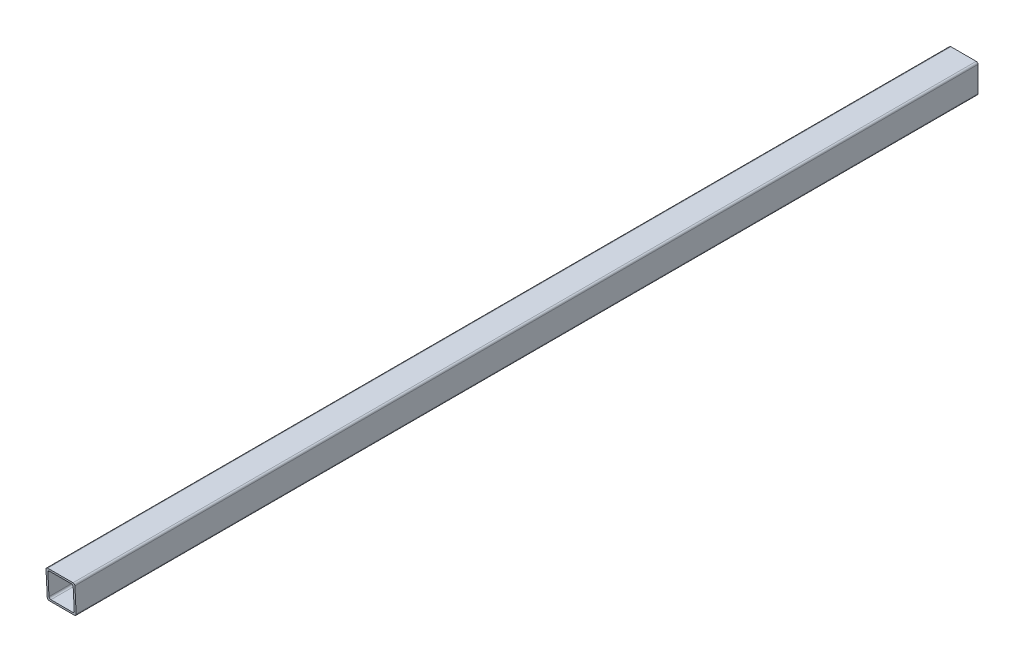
ISO-10303-21;
HEADER;
FILE_DESCRIPTION(('STEP AP214'),'2;1');
FILE_NAME('part.step','',(''),(''),'','','');
FILE_SCHEMA(('AUTOMOTIVE_DESIGN { 1 0 10303 214 1 1 1 1 }'));
ENDSEC;
DATA;
#1=APPLICATION_CONTEXT('core data for automotive mechanical design processes');
#2=APPLICATION_PROTOCOL_DEFINITION('international standard','automotive_design',2000,#1);
#3=PRODUCT_CONTEXT('',#1,'mechanical');
#4=PRODUCT('Part','Part','',(#3));
#5=PRODUCT_RELATED_PRODUCT_CATEGORY('part','',(#4));
#6=PRODUCT_DEFINITION_FORMATION('','',#4);
#7=PRODUCT_DEFINITION_CONTEXT('part definition',#1,'design');
#8=PRODUCT_DEFINITION('design','',#6,#7);
#9=PRODUCT_DEFINITION_SHAPE('','',#8);
#10=(LENGTH_UNIT() NAMED_UNIT(*) SI_UNIT(.MILLI.,.METRE.));
#11=(NAMED_UNIT(*) PLANE_ANGLE_UNIT() SI_UNIT($,.RADIAN.));
#12=(NAMED_UNIT(*) SI_UNIT($,.STERADIAN.) SOLID_ANGLE_UNIT());
#13=UNCERTAINTY_MEASURE_WITH_UNIT(LENGTH_MEASURE(1.E-05),#10,'distance_accuracy_value','');
#14=(GEOMETRIC_REPRESENTATION_CONTEXT(3) GLOBAL_UNCERTAINTY_ASSIGNED_CONTEXT((#13)) GLOBAL_UNIT_ASSIGNED_CONTEXT((#10,
#11,#12)) REPRESENTATION_CONTEXT('',''));
#15=CARTESIAN_POINT('',(0.,0.,0.));
#16=DIRECTION('',(0.,0.,1.));
#17=DIRECTION('',(1.,0.,0.));
#18=AXIS2_PLACEMENT_3D('',#15,#16,#17);
#19=CARTESIAN_POINT('',(-40.,-40.,0.));
#20=DIRECTION('',(0.,0.,1.));
#21=DIRECTION('',(1.,0.,0.));
#22=AXIS2_PLACEMENT_3D('',#19,#20,#21);
#23=PLANE('',#22);
#24=DIRECTION('',(0.,1.,0.));
#25=VECTOR('',#24,1.);
#26=CARTESIAN_POINT('',(40.,40.,0.));
#27=LINE('',#26,#25);
#28=CARTESIAN_POINT('',(40.,-35.,0.));
#29=VERTEX_POINT('',#28);
#30=CARTESIAN_POINT('',(40.,35.,0.));
#31=VERTEX_POINT('',#30);
#32=EDGE_CURVE('E265',#29,#31,#27,.T.);
#33=ORIENTED_EDGE('',*,*,#32,.F.);
#34=CARTESIAN_POINT('',(35.,-35.,0.));
#35=DIRECTION('',(0.,0.,1.));
#36=DIRECTION('',(1.,0.,0.));
#37=AXIS2_PLACEMENT_3D('',#34,#35,#36);
#38=CIRCLE('',#37,5.);
#39=CARTESIAN_POINT('',(35.,-40.,0.));
#40=VERTEX_POINT('',#39);
#41=EDGE_CURVE('E174',#29,#40,#38,.F.);
#42=ORIENTED_EDGE('',*,*,#41,.T.);
#43=DIRECTION('',(1.,0.,0.));
#44=VECTOR('',#43,1.);
#45=CARTESIAN_POINT('',(-40.,-40.,0.));
#46=LINE('',#45,#44);
#47=CARTESIAN_POINT('',(-35.,-40.,0.));
#48=VERTEX_POINT('',#47);
#49=EDGE_CURVE('E269',#48,#40,#46,.T.);
#50=ORIENTED_EDGE('',*,*,#49,.F.);
#51=CARTESIAN_POINT('',(-35.,-35.,0.));
#52=DIRECTION('',(0.,0.,1.));
#53=DIRECTION('',(1.,0.,0.));
#54=AXIS2_PLACEMENT_3D('',#51,#52,#53);
#55=CIRCLE('',#54,5.);
#56=CARTESIAN_POINT('',(-40.,-35.,0.));
#57=VERTEX_POINT('',#56);
#58=EDGE_CURVE('E184',#48,#57,#55,.F.);
#59=ORIENTED_EDGE('',*,*,#58,.T.);
#60=DIRECTION('',(0.,-1.,0.));
#61=VECTOR('',#60,1.);
#62=CARTESIAN_POINT('',(-40.,40.,0.));
#63=LINE('',#62,#61);
#64=CARTESIAN_POINT('',(-40.,35.,0.));
#65=VERTEX_POINT('',#64);
#66=EDGE_CURVE('E272',#65,#57,#63,.T.);
#67=ORIENTED_EDGE('',*,*,#66,.F.);
#68=CARTESIAN_POINT('',(-35.,35.,0.));
#69=DIRECTION('',(0.,0.,1.));
#70=DIRECTION('',(1.,0.,0.));
#71=AXIS2_PLACEMENT_3D('',#68,#69,#70);
#72=CIRCLE('',#71,5.);
#73=CARTESIAN_POINT('',(-35.,40.,0.));
#74=VERTEX_POINT('',#73);
#75=EDGE_CURVE('E175',#65,#74,#72,.F.);
#76=ORIENTED_EDGE('',*,*,#75,.T.);
#77=DIRECTION('',(-1.,0.,0.));
#78=VECTOR('',#77,1.);
#79=CARTESIAN_POINT('',(-40.,40.,0.));
#80=LINE('',#79,#78);
#81=CARTESIAN_POINT('',(35.,40.,0.));
#82=VERTEX_POINT('',#81);
#83=EDGE_CURVE('E264',#82,#74,#80,.T.);
#84=ORIENTED_EDGE('',*,*,#83,.F.);
#85=CARTESIAN_POINT('',(35.,35.,0.));
#86=DIRECTION('',(0.,0.,1.));
#87=DIRECTION('',(1.,0.,0.));
#88=AXIS2_PLACEMENT_3D('',#85,#86,#87);
#89=CIRCLE('',#88,5.);
#90=EDGE_CURVE('E177',#82,#31,#89,.F.);
#91=ORIENTED_EDGE('',*,*,#90,.T.);
#92=EDGE_LOOP('',(#33,#42,#50,#59,#67,#76,#84,#91));
#93=FACE_BOUND('',#92,.T.);
#94=DIRECTION('',(-1.,0.,0.));
#95=VECTOR('',#94,1.);
#96=CARTESIAN_POINT('',(-35.,35.,0.));
#97=LINE('',#96,#95);
#98=CARTESIAN_POINT('',(30.,35.,0.));
#99=VERTEX_POINT('',#98);
#100=CARTESIAN_POINT('',(-30.,35.,0.));
#101=VERTEX_POINT('',#100);
#102=EDGE_CURVE('E241',#99,#101,#97,.T.);
#103=ORIENTED_EDGE('',*,*,#102,.T.);
#104=CARTESIAN_POINT('',(-30.,30.,0.));
#105=DIRECTION('',(0.,0.,1.));
#106=DIRECTION('',(1.,0.,0.));
#107=AXIS2_PLACEMENT_3D('',#104,#105,#106);
#108=CIRCLE('',#107,5.);
#109=CARTESIAN_POINT('',(-35.,30.,0.));
#110=VERTEX_POINT('',#109);
#111=EDGE_CURVE('E46',#101,#110,#108,.T.);
#112=ORIENTED_EDGE('',*,*,#111,.T.);
#113=DIRECTION('',(0.,-1.,0.));
#114=VECTOR('',#113,1.);
#115=CARTESIAN_POINT('',(-35.,35.,0.));
#116=LINE('',#115,#114);
#117=CARTESIAN_POINT('',(-35.,-30.,0.));
#118=VERTEX_POINT('',#117);
#119=EDGE_CURVE('E239',#110,#118,#116,.T.);
#120=ORIENTED_EDGE('',*,*,#119,.T.);
#121=CARTESIAN_POINT('',(-30.,-30.,0.));
#122=DIRECTION('',(0.,0.,1.));
#123=DIRECTION('',(1.,0.,0.));
#124=AXIS2_PLACEMENT_3D('',#121,#122,#123);
#125=CIRCLE('',#124,5.);
#126=CARTESIAN_POINT('',(-30.,-35.,0.));
#127=VERTEX_POINT('',#126);
#128=EDGE_CURVE('E228',#118,#127,#125,.T.);
#129=ORIENTED_EDGE('',*,*,#128,.T.);
#130=DIRECTION('',(1.,0.,0.));
#131=VECTOR('',#130,1.);
#132=CARTESIAN_POINT('',(-35.,-35.,0.));
#133=LINE('',#132,#131);
#134=CARTESIAN_POINT('',(30.,-35.,0.));
#135=VERTEX_POINT('',#134);
#136=EDGE_CURVE('E250',#127,#135,#133,.T.);
#137=ORIENTED_EDGE('',*,*,#136,.T.);
#138=CARTESIAN_POINT('',(30.,-30.,0.));
#139=DIRECTION('',(0.,0.,1.));
#140=DIRECTION('',(1.,0.,0.));
#141=AXIS2_PLACEMENT_3D('',#138,#139,#140);
#142=CIRCLE('',#141,5.);
#143=CARTESIAN_POINT('',(35.,-30.,0.));
#144=VERTEX_POINT('',#143);
#145=EDGE_CURVE('E224',#135,#144,#142,.T.);
#146=ORIENTED_EDGE('',*,*,#145,.T.);
#147=DIRECTION('',(0.,1.,0.));
#148=VECTOR('',#147,1.);
#149=CARTESIAN_POINT('',(35.,35.,0.));
#150=LINE('',#149,#148);
#151=CARTESIAN_POINT('',(35.,30.,0.));
#152=VERTEX_POINT('',#151);
#153=EDGE_CURVE('E276',#144,#152,#150,.T.);
#154=ORIENTED_EDGE('',*,*,#153,.T.);
#155=CARTESIAN_POINT('',(30.,30.,0.));
#156=DIRECTION('',(0.,0.,1.));
#157=DIRECTION('',(1.,0.,0.));
#158=AXIS2_PLACEMENT_3D('',#155,#156,#157);
#159=CIRCLE('',#158,5.);
#160=EDGE_CURVE('E232',#152,#99,#159,.T.);
#161=ORIENTED_EDGE('',*,*,#160,.T.);
#162=EDGE_LOOP('',(#103,#112,#120,#129,#137,#146,#154,#161));
#163=FACE_BOUND('',#162,.T.);
#164=ADVANCED_FACE('F38',(#93,#163),#23,.F.);
#165=CARTESIAN_POINT('',(-40.,40.,3000.));
#166=DIRECTION('',(1.,0.,0.));
#167=DIRECTION('',(0.,1.,0.));
#168=AXIS2_PLACEMENT_3D('',#165,#166,#167);
#169=PLANE('',#168);
#170=ORIENTED_EDGE('',*,*,#66,.T.);
#171=DIRECTION('',(0.,0.,-1.));
#172=VECTOR('',#171,1.);
#173=CARTESIAN_POINT('',(-40.,-35.,3000.));
#174=LINE('',#173,#172);
#175=CARTESIAN_POINT('',(-40.,-35.,2496.2499995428));
#176=VERTEX_POINT('',#175);
#177=EDGE_CURVE('E208',#57,#176,#174,.F.);
#178=ORIENTED_EDGE('',*,*,#177,.T.);
#179=DIRECTION('',(0.,0.998752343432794,0.0499375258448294));
#180=VECTOR('',#179,1.);
#181=CARTESIAN_POINT('',(-40.,-40.,2496.));
#182=LINE('',#181,#180);
#183=CARTESIAN_POINT('',(-40.,35.,2499.74999314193));
#184=VERTEX_POINT('',#183);
#185=EDGE_CURVE('E171',#176,#184,#182,.T.);
#186=ORIENTED_EDGE('',*,*,#185,.T.);
#187=DIRECTION('',(0.,0.,-1.));
#188=VECTOR('',#187,1.);
#189=CARTESIAN_POINT('',(-40.,35.,3000.));
#190=LINE('',#189,#188);
#191=EDGE_CURVE('E205',#184,#65,#190,.T.);
#192=ORIENTED_EDGE('',*,*,#191,.T.);
#193=EDGE_LOOP('',(#170,#178,#186,#192));
#194=FACE_BOUND('',#193,.T.);
#195=ADVANCED_FACE('F293',(#194),#169,.F.);
#196=CARTESIAN_POINT('',(-40.,-40.,3000.));
#197=DIRECTION('',(0.,1.,0.));
#198=DIRECTION('',(-1.,0.,0.));
#199=AXIS2_PLACEMENT_3D('',#196,#197,#198);
#200=PLANE('',#199);
#201=ORIENTED_EDGE('',*,*,#49,.T.);
#202=DIRECTION('',(0.,0.,-1.));
#203=VECTOR('',#202,1.);
#204=CARTESIAN_POINT('',(35.,-40.,3000.));
#205=LINE('',#204,#203);
#206=CARTESIAN_POINT('',(35.,-40.,2496.));
#207=VERTEX_POINT('',#206);
#208=EDGE_CURVE('E190',#40,#207,#205,.F.);
#209=ORIENTED_EDGE('',*,*,#208,.T.);
#210=DIRECTION('',(1.,0.,0.));
#211=VECTOR('',#210,1.);
#212=CARTESIAN_POINT('',(-40.,-40.,2496.));
#213=LINE('',#212,#211);
#214=CARTESIAN_POINT('',(-35.,-40.,2496.));
#215=VERTEX_POINT('',#214);
#216=EDGE_CURVE('E156',#215,#207,#213,.T.);
#217=ORIENTED_EDGE('',*,*,#216,.F.);
#218=DIRECTION('',(0.,0.,-1.));
#219=VECTOR('',#218,1.);
#220=CARTESIAN_POINT('',(-35.,-40.,3000.));
#221=LINE('',#220,#219);
#222=EDGE_CURVE('E187',#215,#48,#221,.T.);
#223=ORIENTED_EDGE('',*,*,#222,.T.);
#224=EDGE_LOOP('',(#201,#209,#217,#223));
#225=FACE_BOUND('',#224,.T.);
#226=ADVANCED_FACE('F307',(#225),#200,.F.);
#227=CARTESIAN_POINT('',(40.,40.,3000.));
#228=DIRECTION('',(-1.,0.,0.));
#229=DIRECTION('',(0.,-1.,0.));
#230=AXIS2_PLACEMENT_3D('',#227,#228,#229);
#231=PLANE('',#230);
#232=DIRECTION('',(0.,0.998752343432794,0.0499375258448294));
#233=VECTOR('',#232,1.);
#234=CARTESIAN_POINT('',(40.,-40.,2496.));
#235=LINE('',#234,#233);
#236=CARTESIAN_POINT('',(40.,-35.,2496.2499995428));
#237=VERTEX_POINT('',#236);
#238=CARTESIAN_POINT('',(40.,35.,2499.74999314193));
#239=VERTEX_POINT('',#238);
#240=EDGE_CURVE('E154',#237,#239,#235,.T.);
#241=ORIENTED_EDGE('',*,*,#240,.F.);
#242=DIRECTION('',(0.,0.,-1.));
#243=VECTOR('',#242,1.);
#244=CARTESIAN_POINT('',(40.,-35.,3000.));
#245=LINE('',#244,#243);
#246=EDGE_CURVE('E167',#237,#29,#245,.T.);
#247=ORIENTED_EDGE('',*,*,#246,.T.);
#248=ORIENTED_EDGE('',*,*,#32,.T.);
#249=DIRECTION('',(0.,0.,-1.));
#250=VECTOR('',#249,1.);
#251=CARTESIAN_POINT('',(40.,35.,3000.));
#252=LINE('',#251,#250);
#253=EDGE_CURVE('E170',#31,#239,#252,.F.);
#254=ORIENTED_EDGE('',*,*,#253,.T.);
#255=EDGE_LOOP('',(#241,#247,#248,#254));
#256=FACE_BOUND('',#255,.T.);
#257=ADVANCED_FACE('F165',(#256),#231,.F.);
#258=CARTESIAN_POINT('',(-40.,40.,3000.));
#259=DIRECTION('',(0.,-1.,0.));
#260=DIRECTION('',(1.,0.,0.));
#261=AXIS2_PLACEMENT_3D('',#258,#259,#260);
#262=PLANE('',#261);
#263=DIRECTION('',(1.,0.,0.));
#264=VECTOR('',#263,1.);
#265=CARTESIAN_POINT('',(-40.,40.,2499.99999268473));
#266=LINE('',#265,#264);
#267=CARTESIAN_POINT('',(-35.,40.,2499.99999268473));
#268=VERTEX_POINT('',#267);
#269=CARTESIAN_POINT('',(35.,40.,2499.99999268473));
#270=VERTEX_POINT('',#269);
#271=EDGE_CURVE('E251',#268,#270,#266,.T.);
#272=ORIENTED_EDGE('',*,*,#271,.T.);
#273=DIRECTION('',(0.,0.,-1.));
#274=VECTOR('',#273,1.);
#275=CARTESIAN_POINT('',(35.,40.,3000.));
#276=LINE('',#275,#274);
#277=EDGE_CURVE('E221',#270,#82,#276,.T.);
#278=ORIENTED_EDGE('',*,*,#277,.T.);
#279=ORIENTED_EDGE('',*,*,#83,.T.);
#280=DIRECTION('',(0.,0.,-1.));
#281=VECTOR('',#280,1.);
#282=CARTESIAN_POINT('',(-35.,40.,3000.));
#283=LINE('',#282,#281);
#284=EDGE_CURVE('E60',#74,#268,#283,.F.);
#285=ORIENTED_EDGE('',*,*,#284,.T.);
#286=EDGE_LOOP('',(#272,#278,#279,#285));
#287=FACE_BOUND('',#286,.T.);
#288=ADVANCED_FACE('F301',(#287),#262,.F.);
#289=CARTESIAN_POINT('',(-35.,35.,3000.));
#290=DIRECTION('',(1.,0.,0.));
#291=DIRECTION('',(0.,1.,0.));
#292=AXIS2_PLACEMENT_3D('',#289,#290,#291);
#293=PLANE('',#292);
#294=DIRECTION('',(0.,0.998752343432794,0.0499375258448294));
#295=VECTOR('',#294,1.);
#296=CARTESIAN_POINT('',(-35.,59.9500796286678,2500.99749484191));
#297=LINE('',#296,#295);
#298=CARTESIAN_POINT('',(-35.,-30.,2496.49999908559));
#299=VERTEX_POINT('',#298);
#300=CARTESIAN_POINT('',(-35.,30.,2499.49999359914));
#301=VERTEX_POINT('',#300);
#302=EDGE_CURVE('E260',#299,#301,#297,.T.);
#303=ORIENTED_EDGE('',*,*,#302,.F.);
#304=DIRECTION('',(0.,0.,-1.));
#305=VECTOR('',#304,1.);
#306=CARTESIAN_POINT('',(-35.,-30.,0.));
#307=LINE('',#306,#305);
#308=EDGE_CURVE('E212',#299,#118,#307,.T.);
#309=ORIENTED_EDGE('',*,*,#308,.T.);
#310=ORIENTED_EDGE('',*,*,#119,.F.);
#311=DIRECTION('',(0.,0.,-1.));
#312=VECTOR('',#311,1.);
#313=CARTESIAN_POINT('',(-35.,30.,2499.74999314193));
#314=LINE('',#313,#312);
#315=EDGE_CURVE('E210',#110,#301,#314,.F.);
#316=ORIENTED_EDGE('',*,*,#315,.T.);
#317=EDGE_LOOP('',(#303,#309,#310,#316));
#318=FACE_BOUND('',#317,.T.);
#319=ADVANCED_FACE('F247',(#318),#293,.T.);
#320=CARTESIAN_POINT('',(-35.,-35.,3000.));
#321=DIRECTION('',(0.,1.,0.));
#322=DIRECTION('',(0.,0.,1.));
#323=AXIS2_PLACEMENT_3D('',#320,#321,#322);
#324=PLANE('',#323);
#325=DIRECTION('',(-1.,0.,0.));
#326=VECTOR('',#325,1.);
#327=CARTESIAN_POINT('',(-35.,-35.,2496.2499995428));
#328=LINE('',#327,#326);
#329=CARTESIAN_POINT('',(30.,-35.,2496.2499995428));
#330=VERTEX_POINT('',#329);
#331=CARTESIAN_POINT('',(-30.,-35.,2496.2499995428));
#332=VERTEX_POINT('',#331);
#333=EDGE_CURVE('E283',#330,#332,#328,.T.);
#334=ORIENTED_EDGE('',*,*,#333,.F.);
#335=DIRECTION('',(0.,0.,-1.));
#336=VECTOR('',#335,1.);
#337=CARTESIAN_POINT('',(30.,-35.,0.));
#338=LINE('',#337,#336);
#339=EDGE_CURVE('E197',#330,#135,#338,.T.);
#340=ORIENTED_EDGE('',*,*,#339,.T.);
#341=ORIENTED_EDGE('',*,*,#136,.F.);
#342=DIRECTION('',(0.,0.,-1.));
#343=VECTOR('',#342,1.);
#344=CARTESIAN_POINT('',(-30.,-35.,2496.2499995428));
#345=LINE('',#344,#343);
#346=EDGE_CURVE('E160',#127,#332,#345,.F.);
#347=ORIENTED_EDGE('',*,*,#346,.T.);
#348=EDGE_LOOP('',(#334,#340,#341,#347));
#349=FACE_BOUND('',#348,.T.);
#350=ADVANCED_FACE('F351',(#349),#324,.T.);
#351=CARTESIAN_POINT('',(35.,35.,3000.));
#352=DIRECTION('',(-1.,0.,0.));
#353=DIRECTION('',(0.,-1.,0.));
#354=AXIS2_PLACEMENT_3D('',#351,#352,#353);
#355=PLANE('',#354);
#356=ORIENTED_EDGE('',*,*,#153,.F.);
#357=DIRECTION('',(0.,0.,-1.));
#358=VECTOR('',#357,1.);
#359=CARTESIAN_POINT('',(35.,-30.,2496.2499995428));
#360=LINE('',#359,#358);
#361=CARTESIAN_POINT('',(35.,-30.,2496.49999908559));
#362=VERTEX_POINT('',#361);
#363=EDGE_CURVE('E203',#144,#362,#360,.F.);
#364=ORIENTED_EDGE('',*,*,#363,.T.);
#365=DIRECTION('',(0.,-0.998752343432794,-0.0499375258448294));
#366=VECTOR('',#365,1.);
#367=CARTESIAN_POINT('',(35.,59.9500796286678,2500.99749484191));
#368=LINE('',#367,#366);
#369=CARTESIAN_POINT('',(35.,30.,2499.49999359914));
#370=VERTEX_POINT('',#369);
#371=EDGE_CURVE('E285',#370,#362,#368,.T.);
#372=ORIENTED_EDGE('',*,*,#371,.F.);
#373=DIRECTION('',(0.,0.,-1.));
#374=VECTOR('',#373,1.);
#375=CARTESIAN_POINT('',(35.,30.,0.));
#376=LINE('',#375,#374);
#377=EDGE_CURVE('E200',#370,#152,#376,.T.);
#378=ORIENTED_EDGE('',*,*,#377,.T.);
#379=EDGE_LOOP('',(#356,#364,#372,#378));
#380=FACE_BOUND('',#379,.T.);
#381=ADVANCED_FACE('F347',(#380),#355,.T.);
#382=CARTESIAN_POINT('',(-35.,35.,3000.));
#383=DIRECTION('',(0.,-1.,0.));
#384=DIRECTION('',(0.,0.,-1.));
#385=AXIS2_PLACEMENT_3D('',#382,#383,#384);
#386=PLANE('',#385);
#387=ORIENTED_EDGE('',*,*,#102,.F.);
#388=DIRECTION('',(0.,0.,-1.));
#389=VECTOR('',#388,1.);
#390=CARTESIAN_POINT('',(30.,35.,2499.74999314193));
#391=LINE('',#390,#389);
#392=CARTESIAN_POINT('',(30.,35.,2499.74999314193));
#393=VERTEX_POINT('',#392);
#394=EDGE_CURVE('E218',#99,#393,#391,.F.);
#395=ORIENTED_EDGE('',*,*,#394,.T.);
#396=DIRECTION('',(1.,0.,0.));
#397=VECTOR('',#396,1.);
#398=CARTESIAN_POINT('',(-35.,35.,2499.74999314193));
#399=LINE('',#398,#397);
#400=CARTESIAN_POINT('',(-30.,35.,2499.74999314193));
#401=VERTEX_POINT('',#400);
#402=EDGE_CURVE('E179',#401,#393,#399,.T.);
#403=ORIENTED_EDGE('',*,*,#402,.F.);
#404=DIRECTION('',(0.,0.,-1.));
#405=VECTOR('',#404,1.);
#406=CARTESIAN_POINT('',(-30.,35.,0.));
#407=LINE('',#406,#405);
#408=EDGE_CURVE('E215',#401,#101,#407,.T.);
#409=ORIENTED_EDGE('',*,*,#408,.T.);
#410=EDGE_LOOP('',(#387,#395,#403,#409));
#411=FACE_BOUND('',#410,.T.);
#412=ADVANCED_FACE('F262',(#411),#386,.T.);
#413=CARTESIAN_POINT('',(-40.,-40.,2496.));
#414=DIRECTION('',(0.,0.0499375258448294,-0.998752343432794));
#415=DIRECTION('',(0.,0.998752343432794,0.0499375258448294));
#416=AXIS2_PLACEMENT_3D('',#413,#414,#415);
#417=PLANE('',#416);
#418=ORIENTED_EDGE('',*,*,#333,.T.);
#419=CARTESIAN_POINT('',(-30.,-30.,2496.49999908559));
#420=DIRECTION('',(0.,0.0499375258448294,-0.998752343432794));
#421=DIRECTION('',(0.,0.998752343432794,0.0499375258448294));
#422=AXIS2_PLACEMENT_3D('',#419,#420,#421);
#423=ELLIPSE('',#422,5.00624607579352,5.);
#424=EDGE_CURVE('E230',#332,#299,#423,.T.);
#425=ORIENTED_EDGE('',*,*,#424,.T.);
#426=ORIENTED_EDGE('',*,*,#302,.T.);
#427=CARTESIAN_POINT('',(-30.,30.,2499.49999359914));
#428=DIRECTION('',(0.,0.0499375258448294,-0.998752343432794));
#429=DIRECTION('',(0.,0.998752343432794,0.0499375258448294));
#430=AXIS2_PLACEMENT_3D('',#427,#428,#429);
#431=ELLIPSE('',#430,5.00624607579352,5.);
#432=EDGE_CURVE('E11',#301,#401,#431,.T.);
#433=ORIENTED_EDGE('',*,*,#432,.T.);
#434=ORIENTED_EDGE('',*,*,#402,.T.);
#435=CARTESIAN_POINT('',(30.,30.,2499.49999359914));
#436=DIRECTION('',(0.,0.0499375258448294,-0.998752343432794));
#437=DIRECTION('',(0.,0.998752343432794,0.0499375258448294));
#438=AXIS2_PLACEMENT_3D('',#435,#436,#437);
#439=ELLIPSE('',#438,5.00624607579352,5.);
#440=EDGE_CURVE('E234',#393,#370,#439,.T.);
#441=ORIENTED_EDGE('',*,*,#440,.T.);
#442=ORIENTED_EDGE('',*,*,#371,.T.);
#443=CARTESIAN_POINT('',(30.,-30.,2496.49999908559));
#444=DIRECTION('',(0.,0.0499375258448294,-0.998752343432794));
#445=DIRECTION('',(0.,0.998752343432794,0.0499375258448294));
#446=AXIS2_PLACEMENT_3D('',#443,#444,#445);
#447=ELLIPSE('',#446,5.00624607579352,5.);
#448=EDGE_CURVE('E226',#362,#330,#447,.T.);
#449=ORIENTED_EDGE('',*,*,#448,.T.);
#450=EDGE_LOOP('',(#418,#425,#426,#433,#434,#441,#442,#449));
#451=FACE_BOUND('',#450,.T.);
#452=ORIENTED_EDGE('',*,*,#216,.T.);
#453=CARTESIAN_POINT('',(35.,-35.,2496.2499995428));
#454=DIRECTION('',(0.,0.0499375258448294,-0.998752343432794));
#455=DIRECTION('',(0.,-0.998752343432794,-0.0499375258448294));
#456=AXIS2_PLACEMENT_3D('',#453,#454,#455);
#457=ELLIPSE('',#456,5.00624607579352,5.);
#458=EDGE_CURVE('E151',#207,#237,#457,.F.);
#459=ORIENTED_EDGE('',*,*,#458,.T.);
#460=ORIENTED_EDGE('',*,*,#240,.T.);
#461=CARTESIAN_POINT('',(35.,35.,2499.74999314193));
#462=DIRECTION('',(0.,0.0499375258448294,-0.998752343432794));
#463=DIRECTION('',(0.,-0.998752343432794,-0.0499375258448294));
#464=AXIS2_PLACEMENT_3D('',#461,#462,#463);
#465=ELLIPSE('',#464,5.00624607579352,5.);
#466=EDGE_CURVE('E53',#239,#270,#465,.F.);
#467=ORIENTED_EDGE('',*,*,#466,.T.);
#468=ORIENTED_EDGE('',*,*,#271,.F.);
#469=CARTESIAN_POINT('',(-35.,35.,2499.74999314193));
#470=DIRECTION('',(0.,0.0499375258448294,-0.998752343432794));
#471=DIRECTION('',(0.,-0.998752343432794,-0.0499375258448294));
#472=AXIS2_PLACEMENT_3D('',#469,#470,#471);
#473=ELLIPSE('',#472,5.00624607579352,5.);
#474=EDGE_CURVE('E192',#268,#184,#473,.F.);
#475=ORIENTED_EDGE('',*,*,#474,.T.);
#476=ORIENTED_EDGE('',*,*,#185,.F.);
#477=CARTESIAN_POINT('',(-35.,-35.,2496.2499995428));
#478=DIRECTION('',(0.,0.0499375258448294,-0.998752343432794));
#479=DIRECTION('',(0.,-0.998752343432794,-0.0499375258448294));
#480=AXIS2_PLACEMENT_3D('',#477,#478,#479);
#481=ELLIPSE('',#480,5.00624607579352,5.);
#482=EDGE_CURVE('E161',#176,#215,#481,.F.);
#483=ORIENTED_EDGE('',*,*,#482,.T.);
#484=EDGE_LOOP('',(#452,#459,#460,#467,#468,#475,#476,#483));
#485=FACE_BOUND('',#484,.T.);
#486=ADVANCED_FACE('F153',(#451,#485),#417,.F.);
#487=CARTESIAN_POINT('',(35.,-35.,3000.));
#488=DIRECTION('',(0.,0.,-1.));
#489=DIRECTION('',(-1.,0.,0.));
#490=AXIS2_PLACEMENT_3D('',#487,#488,#489);
#491=CYLINDRICAL_SURFACE('',#490,5.);
#492=ORIENTED_EDGE('',*,*,#458,.F.);
#493=ORIENTED_EDGE('',*,*,#208,.F.);
#494=ORIENTED_EDGE('',*,*,#41,.F.);
#495=ORIENTED_EDGE('',*,*,#246,.F.);
#496=EDGE_LOOP('',(#492,#493,#494,#495));
#497=FACE_BOUND('',#496,.T.);
#498=ADVANCED_FACE('F173',(#497),#491,.T.);
#499=CARTESIAN_POINT('',(30.,-30.,3000.));
#500=DIRECTION('',(0.,0.,1.));
#501=DIRECTION('',(1.,0.,0.));
#502=AXIS2_PLACEMENT_3D('',#499,#500,#501);
#503=CYLINDRICAL_SURFACE('',#502,5.);
#504=ORIENTED_EDGE('',*,*,#448,.F.);
#505=ORIENTED_EDGE('',*,*,#363,.F.);
#506=ORIENTED_EDGE('',*,*,#145,.F.);
#507=ORIENTED_EDGE('',*,*,#339,.F.);
#508=EDGE_LOOP('',(#504,#505,#506,#507));
#509=FACE_BOUND('',#508,.T.);
#510=ADVANCED_FACE('F313',(#509),#503,.F.);
#511=CARTESIAN_POINT('',(-35.,-35.,3000.));
#512=DIRECTION('',(0.,0.,-1.));
#513=DIRECTION('',(-1.,0.,0.));
#514=AXIS2_PLACEMENT_3D('',#511,#512,#513);
#515=CYLINDRICAL_SURFACE('',#514,5.);
#516=ORIENTED_EDGE('',*,*,#482,.F.);
#517=ORIENTED_EDGE('',*,*,#177,.F.);
#518=ORIENTED_EDGE('',*,*,#58,.F.);
#519=ORIENTED_EDGE('',*,*,#222,.F.);
#520=EDGE_LOOP('',(#516,#517,#518,#519));
#521=FACE_BOUND('',#520,.T.);
#522=ADVANCED_FACE('F310',(#521),#515,.T.);
#523=CARTESIAN_POINT('',(-30.,-30.,3000.));
#524=DIRECTION('',(0.,0.,1.));
#525=DIRECTION('',(1.,0.,0.));
#526=AXIS2_PLACEMENT_3D('',#523,#524,#525);
#527=CYLINDRICAL_SURFACE('',#526,5.);
#528=ORIENTED_EDGE('',*,*,#424,.F.);
#529=ORIENTED_EDGE('',*,*,#346,.F.);
#530=ORIENTED_EDGE('',*,*,#128,.F.);
#531=ORIENTED_EDGE('',*,*,#308,.F.);
#532=EDGE_LOOP('',(#528,#529,#530,#531));
#533=FACE_BOUND('',#532,.T.);
#534=ADVANCED_FACE('F312',(#533),#527,.F.);
#535=CARTESIAN_POINT('',(30.,30.,3000.));
#536=DIRECTION('',(0.,0.,1.));
#537=DIRECTION('',(1.,0.,0.));
#538=AXIS2_PLACEMENT_3D('',#535,#536,#537);
#539=CYLINDRICAL_SURFACE('',#538,5.);
#540=ORIENTED_EDGE('',*,*,#440,.F.);
#541=ORIENTED_EDGE('',*,*,#394,.F.);
#542=ORIENTED_EDGE('',*,*,#160,.F.);
#543=ORIENTED_EDGE('',*,*,#377,.F.);
#544=EDGE_LOOP('',(#540,#541,#542,#543));
#545=FACE_BOUND('',#544,.T.);
#546=ADVANCED_FACE('F319',(#545),#539,.F.);
#547=CARTESIAN_POINT('',(35.,35.,3000.));
#548=DIRECTION('',(0.,0.,-1.));
#549=DIRECTION('',(-1.,0.,0.));
#550=AXIS2_PLACEMENT_3D('',#547,#548,#549);
#551=CYLINDRICAL_SURFACE('',#550,5.);
#552=ORIENTED_EDGE('',*,*,#466,.F.);
#553=ORIENTED_EDGE('',*,*,#253,.F.);
#554=ORIENTED_EDGE('',*,*,#90,.F.);
#555=ORIENTED_EDGE('',*,*,#277,.F.);
#556=EDGE_LOOP('',(#552,#553,#554,#555));
#557=FACE_BOUND('',#556,.T.);
#558=ADVANCED_FACE('F304',(#557),#551,.T.);
#559=CARTESIAN_POINT('',(-30.,30.,3000.));
#560=DIRECTION('',(0.,0.,1.));
#561=DIRECTION('',(1.,0.,0.));
#562=AXIS2_PLACEMENT_3D('',#559,#560,#561);
#563=CYLINDRICAL_SURFACE('',#562,5.);
#564=ORIENTED_EDGE('',*,*,#432,.F.);
#565=ORIENTED_EDGE('',*,*,#315,.F.);
#566=ORIENTED_EDGE('',*,*,#111,.F.);
#567=ORIENTED_EDGE('',*,*,#408,.F.);
#568=EDGE_LOOP('',(#564,#565,#566,#567));
#569=FACE_BOUND('',#568,.T.);
#570=ADVANCED_FACE('F254',(#569),#563,.F.);
#571=CARTESIAN_POINT('',(-35.,35.,3000.));
#572=DIRECTION('',(0.,0.,-1.));
#573=DIRECTION('',(-1.,0.,0.));
#574=AXIS2_PLACEMENT_3D('',#571,#572,#573);
#575=CYLINDRICAL_SURFACE('',#574,5.);
#576=ORIENTED_EDGE('',*,*,#474,.F.);
#577=ORIENTED_EDGE('',*,*,#284,.F.);
#578=ORIENTED_EDGE('',*,*,#75,.F.);
#579=ORIENTED_EDGE('',*,*,#191,.F.);
#580=EDGE_LOOP('',(#576,#577,#578,#579));
#581=FACE_BOUND('',#580,.T.);
#582=ADVANCED_FACE('F40',(#581),#575,.T.);
#583=CLOSED_SHELL('',(#164,#195,#226,#257,#288,#319,#350,#381,#412,#486,#498,#510,#522,#534,
#546,#558,#570,#582));
#584=MANIFOLD_SOLID_BREP('B2',#583);
#585=ADVANCED_BREP_SHAPE_REPRESENTATION('',(#18,#584),#14);
#586=SHAPE_DEFINITION_REPRESENTATION(#9,#585);
ENDSEC;
END-ISO-10303-21;
